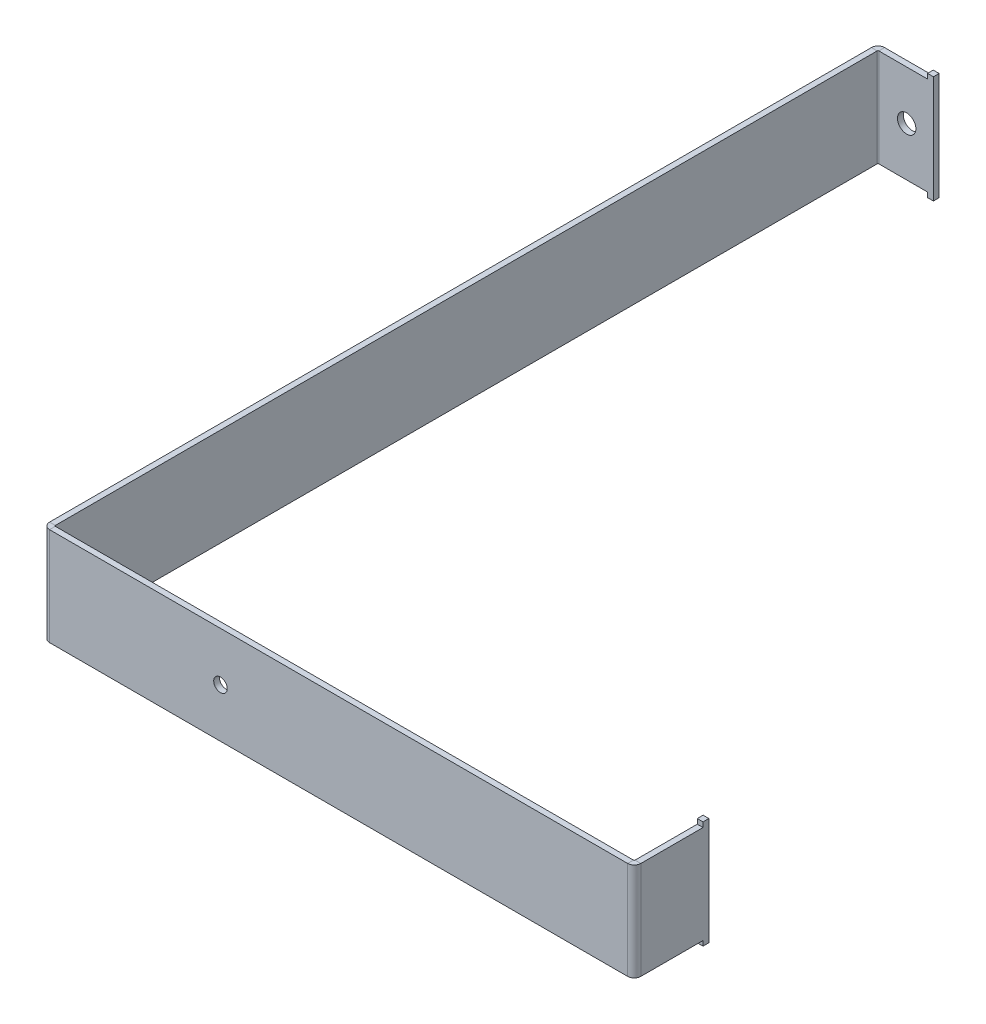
ISO-10303-21;
HEADER;
FILE_DESCRIPTION(('STEP AP214'),'2;1');
FILE_NAME('part.step','',(''),(''),'','','');
FILE_SCHEMA(('AUTOMOTIVE_DESIGN { 1 0 10303 214 1 1 1 1 }'));
ENDSEC;
DATA;
#1=APPLICATION_CONTEXT('core data for automotive mechanical design processes');
#2=APPLICATION_PROTOCOL_DEFINITION('international standard','automotive_design',2000,#1);
#3=PRODUCT_CONTEXT('',#1,'mechanical');
#4=PRODUCT('Part','Part','',(#3));
#5=PRODUCT_RELATED_PRODUCT_CATEGORY('part','',(#4));
#6=PRODUCT_DEFINITION_FORMATION('','',#4);
#7=PRODUCT_DEFINITION_CONTEXT('part definition',#1,'design');
#8=PRODUCT_DEFINITION('design','',#6,#7);
#9=PRODUCT_DEFINITION_SHAPE('','',#8);
#10=(LENGTH_UNIT() NAMED_UNIT(*) SI_UNIT(.MILLI.,.METRE.));
#11=(NAMED_UNIT(*) PLANE_ANGLE_UNIT() SI_UNIT($,.RADIAN.));
#12=(NAMED_UNIT(*) SI_UNIT($,.STERADIAN.) SOLID_ANGLE_UNIT());
#13=UNCERTAINTY_MEASURE_WITH_UNIT(LENGTH_MEASURE(1.E-05),#10,'distance_accuracy_value','');
#14=(GEOMETRIC_REPRESENTATION_CONTEXT(3) GLOBAL_UNCERTAINTY_ASSIGNED_CONTEXT((#13)) GLOBAL_UNIT_ASSIGNED_CONTEXT((#10,
#11,#12)) REPRESENTATION_CONTEXT('',''));
#15=CARTESIAN_POINT('',(0.,0.,0.));
#16=DIRECTION('',(0.,0.,1.));
#17=DIRECTION('',(1.,0.,0.));
#18=AXIS2_PLACEMENT_3D('',#15,#16,#17);
#19=CARTESIAN_POINT('',(-15.8764,0.,-15.0396));
#20=DIRECTION('',(-1.,0.,0.));
#21=DIRECTION('',(0.,0.,1.));
#22=AXIS2_PLACEMENT_3D('',#19,#20,#21);
#23=PLANE('',#22);
#24=DIRECTION('',(0.,0.,-1.));
#25=VECTOR('',#24,1.);
#26=CARTESIAN_POINT('',(-15.8763999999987,12.6999999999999,381.937));
#27=LINE('',#26,#25);
#28=CARTESIAN_POINT('',(-15.8763999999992,12.6999999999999,213.5618));
#29=VERTEX_POINT('',#28);
#30=CARTESIAN_POINT('',(-15.8764,12.7,0.20320000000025));
#31=VERTEX_POINT('',#30);
#32=EDGE_CURVE('E271',#29,#31,#27,.T.);
#33=ORIENTED_EDGE('',*,*,#32,.T.);
#34=DIRECTION('',(0.,-1.,0.));
#35=VECTOR('',#34,1.);
#36=CARTESIAN_POINT('',(-15.8764,0.,0.203200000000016));
#37=LINE('',#36,#35);
#38=CARTESIAN_POINT('',(-15.8764,-12.7,0.203200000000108));
#39=VERTEX_POINT('',#38);
#40=EDGE_CURVE('E358',#31,#39,#37,.T.);
#41=ORIENTED_EDGE('',*,*,#40,.T.);
#42=DIRECTION('',(0.,0.,1.));
#43=VECTOR('',#42,1.);
#44=CARTESIAN_POINT('',(-15.8763999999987,-12.7000000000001,381.937));
#45=LINE('',#44,#43);
#46=CARTESIAN_POINT('',(-15.8763999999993,-12.7,213.5618));
#47=VERTEX_POINT('',#46);
#48=EDGE_CURVE('E274',#39,#47,#45,.T.);
#49=ORIENTED_EDGE('',*,*,#48,.T.);
#50=DIRECTION('',(0.,-1.,0.));
#51=VECTOR('',#50,1.);
#52=CARTESIAN_POINT('',(-15.8763999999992,0.,213.5618));
#53=LINE('',#52,#51);
#54=EDGE_CURVE('E253',#29,#47,#53,.T.);
#55=ORIENTED_EDGE('',*,*,#54,.F.);
#56=EDGE_LOOP('',(#33,#41,#49,#55));
#57=FACE_BOUND('',#56,.T.);
#58=ADVANCED_FACE('F48',(#57),#23,.T.);
#59=CARTESIAN_POINT('',(-14.3764,0.,-15.0396));
#60=DIRECTION('',(-1.,0.,0.));
#61=DIRECTION('',(0.,0.,1.));
#62=AXIS2_PLACEMENT_3D('',#59,#60,#61);
#63=PLANE('',#62);
#64=DIRECTION('',(0.,-1.,0.));
#65=VECTOR('',#64,1.);
#66=CARTESIAN_POINT('',(-14.3764,0.,0.203200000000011));
#67=LINE('',#66,#65);
#68=CARTESIAN_POINT('',(-14.3764,12.7,0.203200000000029));
#69=VERTEX_POINT('',#68);
#70=CARTESIAN_POINT('',(-14.3764,-12.7,0.203200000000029));
#71=VERTEX_POINT('',#70);
#72=EDGE_CURVE('E369',#69,#71,#67,.T.);
#73=ORIENTED_EDGE('',*,*,#72,.F.);
#74=DIRECTION('',(0.,0.,-1.));
#75=VECTOR('',#74,1.);
#76=CARTESIAN_POINT('',(-14.3763999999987,12.6999999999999,381.937));
#77=LINE('',#76,#75);
#78=CARTESIAN_POINT('',(-14.3763999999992,12.6999999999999,213.5618));
#79=VERTEX_POINT('',#78);
#80=EDGE_CURVE('E267',#79,#69,#77,.T.);
#81=ORIENTED_EDGE('',*,*,#80,.F.);
#82=DIRECTION('',(0.,-1.,0.));
#83=VECTOR('',#82,1.);
#84=CARTESIAN_POINT('',(-14.3763999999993,0.,213.5618));
#85=LINE('',#84,#83);
#86=CARTESIAN_POINT('',(-14.3763999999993,-12.7,213.5618));
#87=VERTEX_POINT('',#86);
#88=EDGE_CURVE('E268',#79,#87,#85,.T.);
#89=ORIENTED_EDGE('',*,*,#88,.T.);
#90=DIRECTION('',(0.,0.,1.));
#91=VECTOR('',#90,1.);
#92=CARTESIAN_POINT('',(-14.3763999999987,-12.7000000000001,381.937));
#93=LINE('',#92,#91);
#94=EDGE_CURVE('E263',#71,#87,#93,.T.);
#95=ORIENTED_EDGE('',*,*,#94,.F.);
#96=EDGE_LOOP('',(#73,#81,#89,#95));
#97=FACE_BOUND('',#96,.T.);
#98=ADVANCED_FACE('F50',(#97),#63,.F.);
#99=CARTESIAN_POINT('',(-243.844199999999,0.,215.265000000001));
#100=DIRECTION('',(0.,0.,1.));
#101=DIRECTION('',(1.,0.,0.));
#102=AXIS2_PLACEMENT_3D('',#99,#100,#101);
#103=PLANE('',#102);
#104=CARTESIAN_POINT('',(30.1964000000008,0.,215.265));
#105=DIRECTION('',(0.,0.,-1.));
#106=DIRECTION('',(-1.,0.,0.));
#107=AXIS2_PLACEMENT_3D('',#104,#105,#106);
#108=CIRCLE('',#107,1.75259999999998);
#109=CARTESIAN_POINT('',(28.4438000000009,0.,215.265));
#110=VERTEX_POINT('',#109);
#111=EDGE_CURVE('E297',#110,#110,#108,.T.);
#112=ORIENTED_EDGE('',*,*,#111,.T.);
#113=EDGE_LOOP('',(#112));
#114=FACE_BOUND('',#113,.T.);
#115=DIRECTION('',(-1.,0.,0.));
#116=VECTOR('',#115,1.);
#117=CARTESIAN_POINT('',(153.132400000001,12.6999999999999,215.264999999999));
#118=LINE('',#117,#116);
#119=CARTESIAN_POINT('',(135.911200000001,12.6999999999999,215.264999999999));
#120=VERTEX_POINT('',#119);
#121=CARTESIAN_POINT('',(-14.1731999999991,12.6999999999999,215.265));
#122=VERTEX_POINT('',#121);
#123=EDGE_CURVE('E300',#120,#122,#118,.T.);
#124=ORIENTED_EDGE('',*,*,#123,.T.);
#125=DIRECTION('',(0.,-1.,0.));
#126=VECTOR('',#125,1.);
#127=CARTESIAN_POINT('',(-14.1731999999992,0.,215.265));
#128=LINE('',#127,#126);
#129=CARTESIAN_POINT('',(-14.1731999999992,-12.7,215.265));
#130=VERTEX_POINT('',#129);
#131=EDGE_CURVE('E342',#122,#130,#128,.T.);
#132=ORIENTED_EDGE('',*,*,#131,.T.);
#133=DIRECTION('',(1.,0.,0.));
#134=VECTOR('',#133,1.);
#135=CARTESIAN_POINT('',(153.132400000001,-12.7000000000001,215.264999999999));
#136=LINE('',#135,#134);
#137=CARTESIAN_POINT('',(135.911200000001,-12.7000000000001,215.264999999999));
#138=VERTEX_POINT('',#137);
#139=EDGE_CURVE('E304',#130,#138,#136,.T.);
#140=ORIENTED_EDGE('',*,*,#139,.T.);
#141=DIRECTION('',(0.,-1.,0.));
#142=VECTOR('',#141,1.);
#143=CARTESIAN_POINT('',(135.911200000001,0.,215.264999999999));
#144=LINE('',#143,#142);
#145=EDGE_CURVE('E281',#120,#138,#144,.T.);
#146=ORIENTED_EDGE('',*,*,#145,.F.);
#147=EDGE_LOOP('',(#124,#132,#140,#146));
#148=FACE_BOUND('',#147,.T.);
#149=ADVANCED_FACE('F495',(#114,#148),#103,.T.);
#150=CARTESIAN_POINT('',(-243.844199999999,0.,213.765000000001));
#151=DIRECTION('',(0.,0.,1.));
#152=DIRECTION('',(1.,0.,0.));
#153=AXIS2_PLACEMENT_3D('',#150,#151,#152);
#154=PLANE('',#153);
#155=DIRECTION('',(0.,-1.,0.));
#156=VECTOR('',#155,1.);
#157=CARTESIAN_POINT('',(-14.1731999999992,0.,213.765));
#158=LINE('',#157,#156);
#159=CARTESIAN_POINT('',(-14.1731999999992,12.6999999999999,213.765));
#160=VERTEX_POINT('',#159);
#161=CARTESIAN_POINT('',(-14.1731999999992,-12.7,213.765));
#162=VERTEX_POINT('',#161);
#163=EDGE_CURVE('E353',#160,#162,#158,.T.);
#164=ORIENTED_EDGE('',*,*,#163,.F.);
#165=DIRECTION('',(-1.,0.,0.));
#166=VECTOR('',#165,1.);
#167=CARTESIAN_POINT('',(153.132400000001,12.6999999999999,213.764999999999));
#168=LINE('',#167,#166);
#169=CARTESIAN_POINT('',(135.911200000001,12.6999999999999,213.764999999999));
#170=VERTEX_POINT('',#169);
#171=EDGE_CURVE('E293',#170,#160,#168,.T.);
#172=ORIENTED_EDGE('',*,*,#171,.F.);
#173=DIRECTION('',(0.,-1.,0.));
#174=VECTOR('',#173,1.);
#175=CARTESIAN_POINT('',(135.911200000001,0.,213.764999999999));
#176=LINE('',#175,#174);
#177=CARTESIAN_POINT('',(135.911200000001,-12.7000000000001,213.764999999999));
#178=VERTEX_POINT('',#177);
#179=EDGE_CURVE('E294',#170,#178,#176,.T.);
#180=ORIENTED_EDGE('',*,*,#179,.T.);
#181=DIRECTION('',(1.,0.,0.));
#182=VECTOR('',#181,1.);
#183=CARTESIAN_POINT('',(153.132400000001,-12.7000000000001,213.764999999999));
#184=LINE('',#183,#182);
#185=EDGE_CURVE('E289',#162,#178,#184,.T.);
#186=ORIENTED_EDGE('',*,*,#185,.F.);
#187=EDGE_LOOP('',(#164,#172,#180,#186));
#188=FACE_BOUND('',#187,.T.);
#189=CARTESIAN_POINT('',(30.1964000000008,0.,213.765));
#190=DIRECTION('',(0.,0.,-1.));
#191=DIRECTION('',(-1.,0.,0.));
#192=AXIS2_PLACEMENT_3D('',#189,#190,#191);
#193=CIRCLE('',#192,1.75259999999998);
#194=CARTESIAN_POINT('',(28.4438000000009,0.,213.765));
#195=VERTEX_POINT('',#194);
#196=EDGE_CURVE('E301',#195,#195,#193,.T.);
#197=ORIENTED_EDGE('',*,*,#196,.F.);
#198=EDGE_LOOP('',(#197));
#199=FACE_BOUND('',#198,.T.);
#200=ADVANCED_FACE('F514',(#188,#199),#154,.F.);
#201=CARTESIAN_POINT('',(137.614400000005,-1.30004753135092E-13,594.386799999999));
#202=DIRECTION('',(1.,0.,0.));
#203=DIRECTION('',(0.,0.,-1.));
#204=AXIS2_PLACEMENT_3D('',#201,#202,#203);
#205=PLANE('',#204);
#206=DIRECTION('',(0.,0.,1.));
#207=VECTOR('',#206,1.);
#208=CARTESIAN_POINT('',(137.614400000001,-13.97,-1.5));
#209=LINE('',#208,#207);
#210=CARTESIAN_POINT('',(137.614400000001,-13.97,195.886199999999));
#211=VERTEX_POINT('',#210);
#212=CARTESIAN_POINT('',(137.614400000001,-13.97,197.410199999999));
#213=VERTEX_POINT('',#212);
#214=EDGE_CURVE('E63',#211,#213,#209,.T.);
#215=ORIENTED_EDGE('',*,*,#214,.F.);
#216=DIRECTION('',(0.,-1.,0.));
#217=VECTOR('',#216,1.);
#218=CARTESIAN_POINT('',(137.614400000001,-53.0035349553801,195.886199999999));
#219=LINE('',#218,#217);
#220=CARTESIAN_POINT('',(137.614400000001,13.9699999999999,195.886199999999));
#221=VERTEX_POINT('',#220);
#222=EDGE_CURVE('E327',#221,#211,#219,.T.);
#223=ORIENTED_EDGE('',*,*,#222,.F.);
#224=DIRECTION('',(0.,0.,1.));
#225=VECTOR('',#224,1.);
#226=CARTESIAN_POINT('',(137.614400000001,13.9699999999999,-1.5));
#227=LINE('',#226,#225);
#228=CARTESIAN_POINT('',(137.614400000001,13.9699999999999,197.410199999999));
#229=VERTEX_POINT('',#228);
#230=EDGE_CURVE('E451',#221,#229,#227,.T.);
#231=ORIENTED_EDGE('',*,*,#230,.T.);
#232=DIRECTION('',(0.,-1.,0.));
#233=VECTOR('',#232,1.);
#234=CARTESIAN_POINT('',(137.614400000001,12.6999999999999,197.410199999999));
#235=LINE('',#234,#233);
#236=CARTESIAN_POINT('',(137.614400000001,12.6999999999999,197.410199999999));
#237=VERTEX_POINT('',#236);
#238=EDGE_CURVE('E307',#229,#237,#235,.T.);
#239=ORIENTED_EDGE('',*,*,#238,.T.);
#240=DIRECTION('',(0.,0.,1.));
#241=VECTOR('',#240,1.);
#242=CARTESIAN_POINT('',(137.614400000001,12.6999999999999,197.410199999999));
#243=LINE('',#242,#241);
#244=CARTESIAN_POINT('',(137.614400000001,12.6999999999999,213.561799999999));
#245=VERTEX_POINT('',#244);
#246=EDGE_CURVE('E309',#237,#245,#243,.T.);
#247=ORIENTED_EDGE('',*,*,#246,.T.);
#248=DIRECTION('',(0.,-1.,0.));
#249=VECTOR('',#248,1.);
#250=CARTESIAN_POINT('',(137.614400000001,0.,213.561799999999));
#251=LINE('',#250,#249);
#252=CARTESIAN_POINT('',(137.614400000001,-12.7000000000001,213.561799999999));
#253=VERTEX_POINT('',#252);
#254=EDGE_CURVE('E330',#245,#253,#251,.T.);
#255=ORIENTED_EDGE('',*,*,#254,.T.);
#256=DIRECTION('',(0.,0.,-1.));
#257=VECTOR('',#256,1.);
#258=CARTESIAN_POINT('',(137.614400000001,-12.7000000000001,197.410199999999));
#259=LINE('',#258,#257);
#260=CARTESIAN_POINT('',(137.614400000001,-12.7000000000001,197.410199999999));
#261=VERTEX_POINT('',#260);
#262=EDGE_CURVE('E319',#253,#261,#259,.T.);
#263=ORIENTED_EDGE('',*,*,#262,.T.);
#264=DIRECTION('',(0.,-1.,0.));
#265=VECTOR('',#264,1.);
#266=CARTESIAN_POINT('',(137.614400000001,-15.24,197.410199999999));
#267=LINE('',#266,#265);
#268=EDGE_CURVE('E316',#261,#213,#267,.T.);
#269=ORIENTED_EDGE('',*,*,#268,.T.);
#270=EDGE_LOOP('',(#215,#223,#231,#239,#247,#255,#263,#269));
#271=FACE_BOUND('',#270,.T.);
#272=ADVANCED_FACE('F525',(#271),#205,.T.);
#273=CARTESIAN_POINT('',(137.614400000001,-53.0035349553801,195.886199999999));
#274=DIRECTION('',(0.,0.,-1.));
#275=DIRECTION('',(-1.,0.,0.));
#276=AXIS2_PLACEMENT_3D('',#273,#274,#275);
#277=PLANE('',#276);
#278=DIRECTION('',(1.,0.,0.));
#279=VECTOR('',#278,1.);
#280=CARTESIAN_POINT('',(137.614400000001,-13.97,195.886199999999));
#281=LINE('',#280,#279);
#282=CARTESIAN_POINT('',(136.114400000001,-13.97,195.886199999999));
#283=VERTEX_POINT('',#282);
#284=EDGE_CURVE('E455',#283,#211,#281,.T.);
#285=ORIENTED_EDGE('',*,*,#284,.F.);
#286=DIRECTION('',(0.,-1.,0.));
#287=VECTOR('',#286,1.);
#288=CARTESIAN_POINT('',(136.114400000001,-53.0035349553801,195.886199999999));
#289=LINE('',#288,#287);
#290=CARTESIAN_POINT('',(136.114400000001,13.9699999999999,195.886199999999));
#291=VERTEX_POINT('',#290);
#292=EDGE_CURVE('E326',#291,#283,#289,.T.);
#293=ORIENTED_EDGE('',*,*,#292,.F.);
#294=DIRECTION('',(-1.,0.,0.));
#295=VECTOR('',#294,1.);
#296=CARTESIAN_POINT('',(137.614400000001,13.9699999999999,195.886199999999));
#297=LINE('',#296,#295);
#298=EDGE_CURVE('E437',#221,#291,#297,.T.);
#299=ORIENTED_EDGE('',*,*,#298,.F.);
#300=ORIENTED_EDGE('',*,*,#222,.T.);
#301=EDGE_LOOP('',(#285,#293,#299,#300));
#302=FACE_BOUND('',#301,.T.);
#303=ADVANCED_FACE('F540',(#302),#277,.T.);
#304=CARTESIAN_POINT('',(136.114400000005,-1.29748642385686E-13,594.386799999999));
#305=DIRECTION('',(1.,0.,0.));
#306=DIRECTION('',(0.,0.,-1.));
#307=AXIS2_PLACEMENT_3D('',#304,#305,#306);
#308=PLANE('',#307);
#309=ORIENTED_EDGE('',*,*,#292,.T.);
#310=DIRECTION('',(0.,0.,1.));
#311=VECTOR('',#310,1.);
#312=CARTESIAN_POINT('',(136.114400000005,-13.97,594.386799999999));
#313=LINE('',#312,#311);
#314=CARTESIAN_POINT('',(136.114400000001,-13.97,197.410199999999));
#315=VERTEX_POINT('',#314);
#316=EDGE_CURVE('E457',#283,#315,#313,.T.);
#317=ORIENTED_EDGE('',*,*,#316,.T.);
#318=DIRECTION('',(0.,-1.,0.));
#319=VECTOR('',#318,1.);
#320=CARTESIAN_POINT('',(136.114400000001,-15.24,197.410199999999));
#321=LINE('',#320,#319);
#322=CARTESIAN_POINT('',(136.114400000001,-12.7000000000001,197.410199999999));
#323=VERTEX_POINT('',#322);
#324=EDGE_CURVE('E315',#323,#315,#321,.T.);
#325=ORIENTED_EDGE('',*,*,#324,.F.);
#326=DIRECTION('',(0.,0.,-1.));
#327=VECTOR('',#326,1.);
#328=CARTESIAN_POINT('',(136.114400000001,-12.7000000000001,197.410199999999));
#329=LINE('',#328,#327);
#330=CARTESIAN_POINT('',(136.114400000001,-12.7000000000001,213.561799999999));
#331=VERTEX_POINT('',#330);
#332=EDGE_CURVE('E320',#331,#323,#329,.T.);
#333=ORIENTED_EDGE('',*,*,#332,.F.);
#334=DIRECTION('',(0.,-1.,0.));
#335=VECTOR('',#334,1.);
#336=CARTESIAN_POINT('',(136.114400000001,0.,213.561799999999));
#337=LINE('',#336,#335);
#338=CARTESIAN_POINT('',(136.114400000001,12.6999999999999,213.561799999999));
#339=VERTEX_POINT('',#338);
#340=EDGE_CURVE('E337',#339,#331,#337,.T.);
#341=ORIENTED_EDGE('',*,*,#340,.F.);
#342=DIRECTION('',(0.,0.,1.));
#343=VECTOR('',#342,1.);
#344=CARTESIAN_POINT('',(136.114400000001,12.6999999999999,197.410199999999));
#345=LINE('',#344,#343);
#346=CARTESIAN_POINT('',(136.114400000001,12.6999999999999,197.410199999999));
#347=VERTEX_POINT('',#346);
#348=EDGE_CURVE('E310',#347,#339,#345,.T.);
#349=ORIENTED_EDGE('',*,*,#348,.F.);
#350=DIRECTION('',(0.,-1.,0.));
#351=VECTOR('',#350,1.);
#352=CARTESIAN_POINT('',(136.114400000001,12.6999999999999,197.410199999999));
#353=LINE('',#352,#351);
#354=CARTESIAN_POINT('',(136.114400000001,13.9699999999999,197.410199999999));
#355=VERTEX_POINT('',#354);
#356=EDGE_CURVE('E288',#355,#347,#353,.T.);
#357=ORIENTED_EDGE('',*,*,#356,.F.);
#358=DIRECTION('',(0.,0.,-1.));
#359=VECTOR('',#358,1.);
#360=CARTESIAN_POINT('',(136.114400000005,13.9699999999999,594.386799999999));
#361=LINE('',#360,#359);
#362=EDGE_CURVE('E442',#355,#291,#361,.T.);
#363=ORIENTED_EDGE('',*,*,#362,.T.);
#364=EDGE_LOOP('',(#309,#317,#325,#333,#341,#349,#357,#363));
#365=FACE_BOUND('',#364,.T.);
#366=ADVANCED_FACE('F546',(#365),#308,.F.);
#367=CARTESIAN_POINT('',(137.614400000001,-15.24,197.410199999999));
#368=DIRECTION('',(0.,0.,-1.));
#369=DIRECTION('',(-1.,0.,0.));
#370=AXIS2_PLACEMENT_3D('',#367,#368,#369);
#371=PLANE('',#370);
#372=ORIENTED_EDGE('',*,*,#324,.T.);
#373=DIRECTION('',(1.,0.,0.));
#374=VECTOR('',#373,1.);
#375=CARTESIAN_POINT('',(137.614400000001,-13.97,197.410199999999));
#376=LINE('',#375,#374);
#377=EDGE_CURVE('E460',#315,#213,#376,.T.);
#378=ORIENTED_EDGE('',*,*,#377,.T.);
#379=ORIENTED_EDGE('',*,*,#268,.F.);
#380=DIRECTION('',(-1.,0.,0.));
#381=VECTOR('',#380,1.);
#382=CARTESIAN_POINT('',(137.614400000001,-12.7000000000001,197.410199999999));
#383=LINE('',#382,#381);
#384=EDGE_CURVE('E323',#261,#323,#383,.T.);
#385=ORIENTED_EDGE('',*,*,#384,.T.);
#386=EDGE_LOOP('',(#372,#378,#379,#385));
#387=FACE_BOUND('',#386,.T.);
#388=ADVANCED_FACE('F535',(#387),#371,.F.);
#389=CARTESIAN_POINT('',(137.614400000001,-12.7000000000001,197.410199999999));
#390=DIRECTION('',(0.,1.,0.));
#391=DIRECTION('',(-1.,0.,0.));
#392=AXIS2_PLACEMENT_3D('',#389,#390,#391);
#393=PLANE('',#392);
#394=DIRECTION('',(1.,0.,0.));
#395=VECTOR('',#394,1.);
#396=CARTESIAN_POINT('',(137.614400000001,-12.7000000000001,213.561799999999));
#397=LINE('',#396,#395);
#398=EDGE_CURVE('E339',#331,#253,#397,.T.);
#399=ORIENTED_EDGE('',*,*,#398,.F.);
#400=ORIENTED_EDGE('',*,*,#332,.T.);
#401=ORIENTED_EDGE('',*,*,#384,.F.);
#402=ORIENTED_EDGE('',*,*,#262,.F.);
#403=EDGE_LOOP('',(#399,#400,#401,#402));
#404=FACE_BOUND('',#403,.T.);
#405=ADVANCED_FACE('F531',(#404),#393,.F.);
#406=CARTESIAN_POINT('',(137.614400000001,12.6999999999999,197.410199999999));
#407=DIRECTION('',(0.,0.,-1.));
#408=DIRECTION('',(-1.,0.,0.));
#409=AXIS2_PLACEMENT_3D('',#406,#407,#408);
#410=PLANE('',#409);
#411=ORIENTED_EDGE('',*,*,#238,.F.);
#412=DIRECTION('',(-1.,0.,0.));
#413=VECTOR('',#412,1.);
#414=CARTESIAN_POINT('',(137.614400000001,13.9699999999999,197.410199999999));
#415=LINE('',#414,#413);
#416=EDGE_CURVE('E445',#229,#355,#415,.T.);
#417=ORIENTED_EDGE('',*,*,#416,.T.);
#418=ORIENTED_EDGE('',*,*,#356,.T.);
#419=DIRECTION('',(-1.,0.,0.));
#420=VECTOR('',#419,1.);
#421=CARTESIAN_POINT('',(137.614400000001,12.6999999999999,197.410199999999));
#422=LINE('',#421,#420);
#423=EDGE_CURVE('E312',#237,#347,#422,.T.);
#424=ORIENTED_EDGE('',*,*,#423,.F.);
#425=EDGE_LOOP('',(#411,#417,#418,#424));
#426=FACE_BOUND('',#425,.T.);
#427=ADVANCED_FACE('F551',(#426),#410,.F.);
#428=CARTESIAN_POINT('',(137.614400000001,12.6999999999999,197.410199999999));
#429=DIRECTION('',(0.,-1.,0.));
#430=DIRECTION('',(1.,0.,0.));
#431=AXIS2_PLACEMENT_3D('',#428,#429,#430);
#432=PLANE('',#431);
#433=DIRECTION('',(-1.,0.,0.));
#434=VECTOR('',#433,1.);
#435=CARTESIAN_POINT('',(137.614400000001,12.6999999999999,213.561799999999));
#436=LINE('',#435,#434);
#437=EDGE_CURVE('E335',#245,#339,#436,.T.);
#438=ORIENTED_EDGE('',*,*,#437,.F.);
#439=ORIENTED_EDGE('',*,*,#246,.F.);
#440=ORIENTED_EDGE('',*,*,#423,.T.);
#441=ORIENTED_EDGE('',*,*,#348,.T.);
#442=EDGE_LOOP('',(#438,#439,#440,#441));
#443=FACE_BOUND('',#442,.T.);
#444=ADVANCED_FACE('F553',(#443),#432,.F.);
#445=CARTESIAN_POINT('',(30.1964000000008,0.,215.265));
#446=DIRECTION('',(0.,0.,-1.));
#447=DIRECTION('',(-1.,0.,0.));
#448=AXIS2_PLACEMENT_3D('',#445,#446,#447);
#449=CYLINDRICAL_SURFACE('',#448,1.75259999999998);
#450=ORIENTED_EDGE('',*,*,#111,.F.);
#451=EDGE_LOOP('',(#450));
#452=FACE_BOUND('',#451,.T.);
#453=ORIENTED_EDGE('',*,*,#196,.T.);
#454=EDGE_LOOP('',(#453));
#455=FACE_BOUND('',#454,.T.);
#456=ADVANCED_FACE('F580',(#452,#455),#449,.F.);
#457=CARTESIAN_POINT('',(153.132400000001,12.6999999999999,215.264999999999));
#458=DIRECTION('',(0.,-1.,0.));
#459=DIRECTION('',(0.,0.,1.));
#460=AXIS2_PLACEMENT_3D('',#457,#458,#459);
#461=PLANE('',#460);
#462=DIRECTION('',(0.,0.,-1.));
#463=VECTOR('',#462,1.);
#464=CARTESIAN_POINT('',(-14.1731999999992,12.6999999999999,215.265));
#465=LINE('',#464,#463);
#466=EDGE_CURVE('E351',#122,#160,#465,.T.);
#467=ORIENTED_EDGE('',*,*,#466,.F.);
#468=ORIENTED_EDGE('',*,*,#123,.F.);
#469=DIRECTION('',(0.,0.,-1.));
#470=VECTOR('',#469,1.);
#471=CARTESIAN_POINT('',(135.911200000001,12.6999999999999,215.264999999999));
#472=LINE('',#471,#470);
#473=EDGE_CURVE('E290',#120,#170,#472,.T.);
#474=ORIENTED_EDGE('',*,*,#473,.T.);
#475=ORIENTED_EDGE('',*,*,#171,.T.);
#476=EDGE_LOOP('',(#467,#468,#474,#475));
#477=FACE_BOUND('',#476,.T.);
#478=ADVANCED_FACE('F517',(#477),#461,.F.);
#479=CARTESIAN_POINT('',(153.132400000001,-12.7000000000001,215.264999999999));
#480=DIRECTION('',(0.,1.,0.));
#481=DIRECTION('',(0.,0.,-1.));
#482=AXIS2_PLACEMENT_3D('',#479,#480,#481);
#483=PLANE('',#482);
#484=DIRECTION('',(0.,0.,1.));
#485=VECTOR('',#484,1.);
#486=CARTESIAN_POINT('',(-14.1731999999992,-12.7,215.265));
#487=LINE('',#486,#485);
#488=EDGE_CURVE('E355',#162,#130,#487,.T.);
#489=ORIENTED_EDGE('',*,*,#488,.F.);
#490=ORIENTED_EDGE('',*,*,#185,.T.);
#491=DIRECTION('',(0.,0.,1.));
#492=VECTOR('',#491,1.);
#493=CARTESIAN_POINT('',(135.911200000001,-12.7000000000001,215.264999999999));
#494=LINE('',#493,#492);
#495=EDGE_CURVE('E285',#178,#138,#494,.T.);
#496=ORIENTED_EDGE('',*,*,#495,.T.);
#497=ORIENTED_EDGE('',*,*,#139,.F.);
#498=EDGE_LOOP('',(#489,#490,#496,#497));
#499=FACE_BOUND('',#498,.T.);
#500=ADVANCED_FACE('F499',(#499),#483,.F.);
#501=CARTESIAN_POINT('',(135.911200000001,12.6999999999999,213.561799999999));
#502=DIRECTION('',(0.,1.,0.));
#503=DIRECTION('',(0.,0.,-1.));
#504=AXIS2_PLACEMENT_3D('',#501,#502,#503);
#505=PLANE('',#504);
#506=ORIENTED_EDGE('',*,*,#437,.T.);
#507=CARTESIAN_POINT('',(135.911200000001,12.6999999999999,213.561799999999));
#508=DIRECTION('',(0.,1.,0.));
#509=DIRECTION('',(0.,0.,-1.));
#510=AXIS2_PLACEMENT_3D('',#507,#508,#509);
#511=CIRCLE('',#510,0.2032);
#512=EDGE_CURVE('E262',#339,#170,#511,.F.);
#513=ORIENTED_EDGE('',*,*,#512,.T.);
#514=ORIENTED_EDGE('',*,*,#473,.F.);
#515=CARTESIAN_POINT('',(135.911200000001,12.6999999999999,213.561799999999));
#516=DIRECTION('',(0.,-1.,0.));
#517=DIRECTION('',(0.,0.,1.));
#518=AXIS2_PLACEMENT_3D('',#515,#516,#517);
#519=CIRCLE('',#518,1.70320000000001);
#520=EDGE_CURVE('E275',#245,#120,#519,.T.);
#521=ORIENTED_EDGE('',*,*,#520,.F.);
#522=EDGE_LOOP('',(#506,#513,#514,#521));
#523=FACE_BOUND('',#522,.T.);
#524=ADVANCED_FACE('F520',(#523),#505,.T.);
#525=CARTESIAN_POINT('',(135.911200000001,-12.7000000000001,213.561799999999));
#526=DIRECTION('',(0.,-1.,0.));
#527=DIRECTION('',(0.,0.,1.));
#528=AXIS2_PLACEMENT_3D('',#525,#526,#527);
#529=PLANE('',#528);
#530=CARTESIAN_POINT('',(135.911200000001,-12.7000000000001,213.561799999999));
#531=DIRECTION('',(0.,1.,0.));
#532=DIRECTION('',(0.,0.,-1.));
#533=AXIS2_PLACEMENT_3D('',#530,#531,#532);
#534=CIRCLE('',#533,0.2032);
#535=EDGE_CURVE('E279',#178,#331,#534,.T.);
#536=ORIENTED_EDGE('',*,*,#535,.T.);
#537=ORIENTED_EDGE('',*,*,#398,.T.);
#538=CARTESIAN_POINT('',(135.911200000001,-12.7000000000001,213.561799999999));
#539=DIRECTION('',(0.,1.,0.));
#540=DIRECTION('',(0.,0.,-1.));
#541=AXIS2_PLACEMENT_3D('',#538,#539,#540);
#542=CIRCLE('',#541,1.70320000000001);
#543=EDGE_CURVE('E278',#138,#253,#542,.T.);
#544=ORIENTED_EDGE('',*,*,#543,.F.);
#545=ORIENTED_EDGE('',*,*,#495,.F.);
#546=EDGE_LOOP('',(#536,#537,#544,#545));
#547=FACE_BOUND('',#546,.T.);
#548=ADVANCED_FACE('F504',(#547),#529,.T.);
#549=CARTESIAN_POINT('',(135.911200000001,-25.46672425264,213.561799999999));
#550=DIRECTION('',(0.,1.,0.));
#551=DIRECTION('',(0.,0.,-1.));
#552=AXIS2_PLACEMENT_3D('',#549,#550,#551);
#553=CYLINDRICAL_SURFACE('',#552,1.7032);
#554=ORIENTED_EDGE('',*,*,#145,.T.);
#555=ORIENTED_EDGE('',*,*,#543,.T.);
#556=ORIENTED_EDGE('',*,*,#254,.F.);
#557=ORIENTED_EDGE('',*,*,#520,.T.);
#558=EDGE_LOOP('',(#554,#555,#556,#557));
#559=FACE_BOUND('',#558,.T.);
#560=ADVANCED_FACE('F522',(#559),#553,.T.);
#561=CARTESIAN_POINT('',(135.911200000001,-25.46672425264,213.561799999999));
#562=DIRECTION('',(0.,1.,0.));
#563=DIRECTION('',(0.,0.,-1.));
#564=AXIS2_PLACEMENT_3D('',#561,#562,#563);
#565=CYLINDRICAL_SURFACE('',#564,0.2032);
#566=ORIENTED_EDGE('',*,*,#179,.F.);
#567=ORIENTED_EDGE('',*,*,#512,.F.);
#568=ORIENTED_EDGE('',*,*,#340,.T.);
#569=ORIENTED_EDGE('',*,*,#535,.F.);
#570=EDGE_LOOP('',(#566,#567,#568,#569));
#571=FACE_BOUND('',#570,.T.);
#572=ADVANCED_FACE('F508',(#571),#565,.F.);
#573=CARTESIAN_POINT('',(-15.8763999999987,12.6999999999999,381.937));
#574=DIRECTION('',(0.,-1.,0.));
#575=DIRECTION('',(-1.,0.,0.));
#576=AXIS2_PLACEMENT_3D('',#573,#574,#575);
#577=PLANE('',#576);
#578=DIRECTION('',(1.,0.,0.));
#579=VECTOR('',#578,1.);
#580=CARTESIAN_POINT('',(-15.8764,12.7,0.203200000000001));
#581=LINE('',#580,#579);
#582=EDGE_CURVE('E367',#31,#69,#581,.T.);
#583=ORIENTED_EDGE('',*,*,#582,.F.);
#584=ORIENTED_EDGE('',*,*,#32,.F.);
#585=DIRECTION('',(1.,0.,0.));
#586=VECTOR('',#585,1.);
#587=CARTESIAN_POINT('',(-15.8763999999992,12.6999999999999,213.5618));
#588=LINE('',#587,#586);
#589=EDGE_CURVE('E264',#29,#79,#588,.T.);
#590=ORIENTED_EDGE('',*,*,#589,.T.);
#591=ORIENTED_EDGE('',*,*,#80,.T.);
#592=EDGE_LOOP('',(#583,#584,#590,#591));
#593=FACE_BOUND('',#592,.T.);
#594=ADVANCED_FACE('F566',(#593),#577,.F.);
#595=CARTESIAN_POINT('',(-15.8763999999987,-12.7000000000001,381.937));
#596=DIRECTION('',(0.,1.,0.));
#597=DIRECTION('',(1.,0.,0.));
#598=AXIS2_PLACEMENT_3D('',#595,#596,#597);
#599=PLANE('',#598);
#600=DIRECTION('',(-1.,0.,0.));
#601=VECTOR('',#600,1.);
#602=CARTESIAN_POINT('',(-15.8764,-12.7,0.203199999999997));
#603=LINE('',#602,#601);
#604=EDGE_CURVE('E371',#71,#39,#603,.T.);
#605=ORIENTED_EDGE('',*,*,#604,.F.);
#606=ORIENTED_EDGE('',*,*,#94,.T.);
#607=DIRECTION('',(-1.,0.,0.));
#608=VECTOR('',#607,1.);
#609=CARTESIAN_POINT('',(-15.8763999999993,-12.7,213.5618));
#610=LINE('',#609,#608);
#611=EDGE_CURVE('E259',#87,#47,#610,.T.);
#612=ORIENTED_EDGE('',*,*,#611,.T.);
#613=ORIENTED_EDGE('',*,*,#48,.F.);
#614=EDGE_LOOP('',(#605,#606,#612,#613));
#615=FACE_BOUND('',#614,.T.);
#616=ADVANCED_FACE('F479',(#615),#599,.F.);
#617=CARTESIAN_POINT('',(-14.1731999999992,12.6999999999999,213.5618));
#618=DIRECTION('',(0.,1.,0.));
#619=DIRECTION('',(1.,0.,0.));
#620=AXIS2_PLACEMENT_3D('',#617,#618,#619);
#621=PLANE('',#620);
#622=ORIENTED_EDGE('',*,*,#466,.T.);
#623=CARTESIAN_POINT('',(-14.1731999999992,12.6999999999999,213.5618));
#624=DIRECTION('',(0.,1.,0.));
#625=DIRECTION('',(1.,0.,0.));
#626=AXIS2_PLACEMENT_3D('',#623,#624,#625);
#627=CIRCLE('',#626,0.2032);
#628=EDGE_CURVE('E254',#160,#79,#627,.F.);
#629=ORIENTED_EDGE('',*,*,#628,.T.);
#630=ORIENTED_EDGE('',*,*,#589,.F.);
#631=CARTESIAN_POINT('',(-14.1731999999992,12.6999999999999,213.5618));
#632=DIRECTION('',(0.,-1.,0.));
#633=DIRECTION('',(-1.,0.,0.));
#634=AXIS2_PLACEMENT_3D('',#631,#632,#633);
#635=CIRCLE('',#634,1.70319999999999);
#636=EDGE_CURVE('E247',#122,#29,#635,.T.);
#637=ORIENTED_EDGE('',*,*,#636,.F.);
#638=EDGE_LOOP('',(#622,#629,#630,#637));
#639=FACE_BOUND('',#638,.T.);
#640=ADVANCED_FACE('F572',(#639),#621,.T.);
#641=CARTESIAN_POINT('',(-14.1731999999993,-12.7,213.5618));
#642=DIRECTION('',(0.,-1.,0.));
#643=DIRECTION('',(-1.,0.,0.));
#644=AXIS2_PLACEMENT_3D('',#641,#642,#643);
#645=PLANE('',#644);
#646=CARTESIAN_POINT('',(-14.1731999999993,-12.7,213.5618));
#647=DIRECTION('',(0.,1.,0.));
#648=DIRECTION('',(1.,0.,0.));
#649=AXIS2_PLACEMENT_3D('',#646,#647,#648);
#650=CIRCLE('',#649,0.2032);
#651=EDGE_CURVE('E251',#87,#162,#650,.T.);
#652=ORIENTED_EDGE('',*,*,#651,.T.);
#653=ORIENTED_EDGE('',*,*,#488,.T.);
#654=CARTESIAN_POINT('',(-14.1731999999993,-12.7,213.5618));
#655=DIRECTION('',(0.,1.,0.));
#656=DIRECTION('',(1.,0.,0.));
#657=AXIS2_PLACEMENT_3D('',#654,#655,#656);
#658=CIRCLE('',#657,1.70319999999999);
#659=EDGE_CURVE('E250',#47,#130,#658,.T.);
#660=ORIENTED_EDGE('',*,*,#659,.F.);
#661=ORIENTED_EDGE('',*,*,#611,.F.);
#662=EDGE_LOOP('',(#652,#653,#660,#661));
#663=FACE_BOUND('',#662,.T.);
#664=ADVANCED_FACE('F488',(#663),#645,.T.);
#665=CARTESIAN_POINT('',(-14.1731999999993,-25.46672425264,213.5618));
#666=DIRECTION('',(0.,1.,0.));
#667=DIRECTION('',(1.,0.,0.));
#668=AXIS2_PLACEMENT_3D('',#665,#666,#667);
#669=CYLINDRICAL_SURFACE('',#668,1.7032);
#670=ORIENTED_EDGE('',*,*,#54,.T.);
#671=ORIENTED_EDGE('',*,*,#659,.T.);
#672=ORIENTED_EDGE('',*,*,#131,.F.);
#673=ORIENTED_EDGE('',*,*,#636,.T.);
#674=EDGE_LOOP('',(#670,#671,#672,#673));
#675=FACE_BOUND('',#674,.T.);
#676=ADVANCED_FACE('F485',(#675),#669,.T.);
#677=CARTESIAN_POINT('',(-14.1731999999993,-25.46672425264,213.5618));
#678=DIRECTION('',(0.,1.,0.));
#679=DIRECTION('',(1.,0.,0.));
#680=AXIS2_PLACEMENT_3D('',#677,#678,#679);
#681=CYLINDRICAL_SURFACE('',#680,0.2032);
#682=ORIENTED_EDGE('',*,*,#88,.F.);
#683=ORIENTED_EDGE('',*,*,#628,.F.);
#684=ORIENTED_EDGE('',*,*,#163,.T.);
#685=ORIENTED_EDGE('',*,*,#651,.F.);
#686=EDGE_LOOP('',(#682,#683,#684,#685));
#687=FACE_BOUND('',#686,.T.);
#688=ADVANCED_FACE('F613',(#687),#681,.F.);
#689=CARTESIAN_POINT('',(-6.93391241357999,0.,-1.5));
#690=DIRECTION('',(0.,0.,1.));
#691=DIRECTION('',(1.,0.,0.));
#692=AXIS2_PLACEMENT_3D('',#689,#690,#691);
#693=CYLINDRICAL_SURFACE('',#692,2.38760000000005);
#694=CARTESIAN_POINT('',(-6.93391241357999,0.,-1.5));
#695=DIRECTION('',(0.,0.,1.));
#696=DIRECTION('',(1.,0.,0.));
#697=AXIS2_PLACEMENT_3D('',#694,#695,#696);
#698=CIRCLE('',#697,2.38760000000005);
#699=CARTESIAN_POINT('',(-4.54631241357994,0.,-1.5));
#700=VERTEX_POINT('',#699);
#701=EDGE_CURVE('E413',#700,#700,#698,.T.);
#702=ORIENTED_EDGE('',*,*,#701,.F.);
#703=EDGE_LOOP('',(#702));
#704=FACE_BOUND('',#703,.T.);
#705=CARTESIAN_POINT('',(-6.93391241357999,0.,0.));
#706=DIRECTION('',(0.,0.,1.));
#707=DIRECTION('',(1.,0.,0.));
#708=AXIS2_PLACEMENT_3D('',#705,#706,#707);
#709=CIRCLE('',#708,2.38760000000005);
#710=CARTESIAN_POINT('',(-4.54631241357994,0.,0.));
#711=VERTEX_POINT('',#710);
#712=EDGE_CURVE('E241',#711,#711,#709,.T.);
#713=ORIENTED_EDGE('',*,*,#712,.T.);
#714=EDGE_LOOP('',(#713));
#715=FACE_BOUND('',#714,.T.);
#716=ADVANCED_FACE('F616',(#704,#715),#693,.F.);
#717=CARTESIAN_POINT('',(-1.52399999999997,12.7,-1.5));
#718=DIRECTION('',(1.,0.,0.));
#719=DIRECTION('',(0.,0.,-1.));
#720=AXIS2_PLACEMENT_3D('',#717,#718,#719);
#721=PLANE('',#720);
#722=DIRECTION('',(0.,1.,0.));
#723=VECTOR('',#722,1.);
#724=CARTESIAN_POINT('',(-1.52399999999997,12.7,0.));
#725=LINE('',#724,#723);
#726=CARTESIAN_POINT('',(-1.52399999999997,12.7,0.));
#727=VERTEX_POINT('',#726);
#728=CARTESIAN_POINT('',(-1.52399999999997,13.9699999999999,0.));
#729=VERTEX_POINT('',#728);
#730=EDGE_CURVE('E238',#727,#729,#725,.T.);
#731=ORIENTED_EDGE('',*,*,#730,.T.);
#732=DIRECTION('',(0.,0.,-1.));
#733=VECTOR('',#732,1.);
#734=CARTESIAN_POINT('',(-1.52399999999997,13.9699999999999,-1.5));
#735=LINE('',#734,#733);
#736=CARTESIAN_POINT('',(-1.52399999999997,13.9699999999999,-1.5));
#737=VERTEX_POINT('',#736);
#738=EDGE_CURVE('E391',#729,#737,#735,.T.);
#739=ORIENTED_EDGE('',*,*,#738,.T.);
#740=DIRECTION('',(0.,1.,0.));
#741=VECTOR('',#740,1.);
#742=CARTESIAN_POINT('',(-1.52399999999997,12.7,-1.5));
#743=LINE('',#742,#741);
#744=CARTESIAN_POINT('',(-1.52399999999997,12.7,-1.5));
#745=VERTEX_POINT('',#744);
#746=EDGE_CURVE('E393',#745,#737,#743,.T.);
#747=ORIENTED_EDGE('',*,*,#746,.F.);
#748=DIRECTION('',(0.,0.,1.));
#749=VECTOR('',#748,1.);
#750=CARTESIAN_POINT('',(-1.52399999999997,12.7,-1.5));
#751=LINE('',#750,#749);
#752=EDGE_CURVE('E232',#745,#727,#751,.T.);
#753=ORIENTED_EDGE('',*,*,#752,.T.);
#754=EDGE_LOOP('',(#731,#739,#747,#753));
#755=FACE_BOUND('',#754,.T.);
#756=ADVANCED_FACE('F389',(#755),#721,.F.);
#757=CARTESIAN_POINT('',(-1.52399999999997,-15.24,-1.5));
#758=DIRECTION('',(1.,0.,0.));
#759=DIRECTION('',(0.,0.,-1.));
#760=AXIS2_PLACEMENT_3D('',#757,#758,#759);
#761=PLANE('',#760);
#762=DIRECTION('',(0.,1.,0.));
#763=VECTOR('',#762,1.);
#764=CARTESIAN_POINT('',(-1.52399999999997,-15.24,-1.5));
#765=LINE('',#764,#763);
#766=CARTESIAN_POINT('',(-1.52399999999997,-13.97,-1.5));
#767=VERTEX_POINT('',#766);
#768=CARTESIAN_POINT('',(-1.52399999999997,-12.7,-1.5));
#769=VERTEX_POINT('',#768);
#770=EDGE_CURVE('E227',#767,#769,#765,.T.);
#771=ORIENTED_EDGE('',*,*,#770,.F.);
#772=DIRECTION('',(0.,0.,1.));
#773=VECTOR('',#772,1.);
#774=CARTESIAN_POINT('',(-1.52399999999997,-13.97,-1.5));
#775=LINE('',#774,#773);
#776=CARTESIAN_POINT('',(-1.52399999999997,-13.97,0.));
#777=VERTEX_POINT('',#776);
#778=EDGE_CURVE('E209',#767,#777,#775,.T.);
#779=ORIENTED_EDGE('',*,*,#778,.T.);
#780=DIRECTION('',(0.,1.,0.));
#781=VECTOR('',#780,1.);
#782=CARTESIAN_POINT('',(-1.52399999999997,-15.24,0.));
#783=LINE('',#782,#781);
#784=CARTESIAN_POINT('',(-1.52399999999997,-12.7,0.));
#785=VERTEX_POINT('',#784);
#786=EDGE_CURVE('E228',#777,#785,#783,.T.);
#787=ORIENTED_EDGE('',*,*,#786,.T.);
#788=DIRECTION('',(0.,0.,1.));
#789=VECTOR('',#788,1.);
#790=CARTESIAN_POINT('',(-1.52399999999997,-12.7,-1.5));
#791=LINE('',#790,#789);
#792=EDGE_CURVE('E256',#769,#785,#791,.T.);
#793=ORIENTED_EDGE('',*,*,#792,.F.);
#794=EDGE_LOOP('',(#771,#779,#787,#793));
#795=FACE_BOUND('',#794,.T.);
#796=ADVANCED_FACE('F464',(#795),#761,.F.);
#797=CARTESIAN_POINT('',(0.,-40.64,-1.5));
#798=DIRECTION('',(1.,0.,0.));
#799=DIRECTION('',(0.,0.,-1.));
#800=AXIS2_PLACEMENT_3D('',#797,#798,#799);
#801=PLANE('',#800);
#802=DIRECTION('',(0.,0.,1.));
#803=VECTOR('',#802,1.);
#804=CARTESIAN_POINT('',(0.,-13.97,-1.5));
#805=LINE('',#804,#803);
#806=CARTESIAN_POINT('',(0.,-13.97,-1.5));
#807=VERTEX_POINT('',#806);
#808=CARTESIAN_POINT('',(0.,-13.97,0.));
#809=VERTEX_POINT('',#808);
#810=EDGE_CURVE('E71',#807,#809,#805,.T.);
#811=ORIENTED_EDGE('',*,*,#810,.F.);
#812=DIRECTION('',(0.,1.,0.));
#813=VECTOR('',#812,1.);
#814=CARTESIAN_POINT('',(0.,-40.64,-1.5));
#815=LINE('',#814,#813);
#816=CARTESIAN_POINT('',(0.,13.9699999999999,-1.5));
#817=VERTEX_POINT('',#816);
#818=EDGE_CURVE('E218',#807,#817,#815,.T.);
#819=ORIENTED_EDGE('',*,*,#818,.T.);
#820=DIRECTION('',(0.,0.,-1.));
#821=VECTOR('',#820,1.);
#822=CARTESIAN_POINT('',(0.,13.9699999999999,-1.5));
#823=LINE('',#822,#821);
#824=CARTESIAN_POINT('',(0.,13.9699999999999,0.));
#825=VERTEX_POINT('',#824);
#826=EDGE_CURVE('E449',#825,#817,#823,.T.);
#827=ORIENTED_EDGE('',*,*,#826,.F.);
#828=DIRECTION('',(0.,1.,0.));
#829=VECTOR('',#828,1.);
#830=CARTESIAN_POINT('',(0.,-40.64,0.));
#831=LINE('',#830,#829);
#832=EDGE_CURVE('E220',#809,#825,#831,.T.);
#833=ORIENTED_EDGE('',*,*,#832,.F.);
#834=EDGE_LOOP('',(#811,#819,#827,#833));
#835=FACE_BOUND('',#834,.T.);
#836=ADVANCED_FACE('F216',(#835),#801,.T.);
#837=CARTESIAN_POINT('',(0.,0.,-1.5));
#838=DIRECTION('',(0.,0.,-1.));
#839=DIRECTION('',(-1.,0.,0.));
#840=AXIS2_PLACEMENT_3D('',#837,#838,#839);
#841=PLANE('',#840);
#842=DIRECTION('',(-1.,0.,0.));
#843=VECTOR('',#842,1.);
#844=CARTESIAN_POINT('',(-15.8763999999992,-13.97,-1.5));
#845=LINE('',#844,#843);
#846=EDGE_CURVE('E206',#807,#767,#845,.T.);
#847=ORIENTED_EDGE('',*,*,#846,.T.);
#848=ORIENTED_EDGE('',*,*,#770,.T.);
#849=DIRECTION('',(-1.,0.,0.));
#850=VECTOR('',#849,1.);
#851=CARTESIAN_POINT('',(-396.9766,-12.7,-1.5));
#852=LINE('',#851,#850);
#853=CARTESIAN_POINT('',(-14.1732000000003,-12.7,-1.5));
#854=VERTEX_POINT('',#853);
#855=EDGE_CURVE('E230',#769,#854,#852,.T.);
#856=ORIENTED_EDGE('',*,*,#855,.T.);
#857=DIRECTION('',(0.,-1.,0.));
#858=VECTOR('',#857,1.);
#859=CARTESIAN_POINT('',(-14.1732,0.,-1.5));
#860=LINE('',#859,#858);
#861=CARTESIAN_POINT('',(-14.1732,12.7,-1.5));
#862=VERTEX_POINT('',#861);
#863=EDGE_CURVE('E244',#862,#854,#860,.T.);
#864=ORIENTED_EDGE('',*,*,#863,.F.);
#865=DIRECTION('',(1.,0.,0.));
#866=VECTOR('',#865,1.);
#867=CARTESIAN_POINT('',(-396.9766,12.7,-1.5));
#868=LINE('',#867,#866);
#869=EDGE_CURVE('E398',#862,#745,#868,.T.);
#870=ORIENTED_EDGE('',*,*,#869,.T.);
#871=ORIENTED_EDGE('',*,*,#746,.T.);
#872=DIRECTION('',(1.,0.,0.));
#873=VECTOR('',#872,1.);
#874=CARTESIAN_POINT('',(-15.8763999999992,13.9699999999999,-1.5));
#875=LINE('',#874,#873);
#876=EDGE_CURVE('E226',#737,#817,#875,.T.);
#877=ORIENTED_EDGE('',*,*,#876,.T.);
#878=ORIENTED_EDGE('',*,*,#818,.F.);
#879=EDGE_LOOP('',(#847,#848,#856,#864,#870,#871,#877,#878));
#880=FACE_BOUND('',#879,.T.);
#881=ORIENTED_EDGE('',*,*,#701,.T.);
#882=EDGE_LOOP('',(#881));
#883=FACE_BOUND('',#882,.T.);
#884=ADVANCED_FACE('F223',(#880,#883),#841,.T.);
#885=CARTESIAN_POINT('',(0.,0.,0.));
#886=DIRECTION('',(0.,0.,-1.));
#887=DIRECTION('',(-1.,0.,0.));
#888=AXIS2_PLACEMENT_3D('',#885,#886,#887);
#889=PLANE('',#888);
#890=ORIENTED_EDGE('',*,*,#712,.F.);
#891=EDGE_LOOP('',(#890));
#892=FACE_BOUND('',#891,.T.);
#893=ORIENTED_EDGE('',*,*,#786,.F.);
#894=DIRECTION('',(1.,0.,0.));
#895=VECTOR('',#894,1.);
#896=CARTESIAN_POINT('',(0.,-13.97,0.));
#897=LINE('',#896,#895);
#898=EDGE_CURVE('E12',#777,#809,#897,.T.);
#899=ORIENTED_EDGE('',*,*,#898,.T.);
#900=ORIENTED_EDGE('',*,*,#832,.T.);
#901=DIRECTION('',(-1.,0.,0.));
#902=VECTOR('',#901,1.);
#903=CARTESIAN_POINT('',(0.,13.9699999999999,0.));
#904=LINE('',#903,#902);
#905=EDGE_CURVE('E56',#825,#729,#904,.T.);
#906=ORIENTED_EDGE('',*,*,#905,.T.);
#907=ORIENTED_EDGE('',*,*,#730,.F.);
#908=DIRECTION('',(1.,0.,0.));
#909=VECTOR('',#908,1.);
#910=CARTESIAN_POINT('',(-396.9766,12.7,0.));
#911=LINE('',#910,#909);
#912=CARTESIAN_POINT('',(-14.1732000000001,12.7,0.));
#913=VERTEX_POINT('',#912);
#914=EDGE_CURVE('E399',#913,#727,#911,.T.);
#915=ORIENTED_EDGE('',*,*,#914,.F.);
#916=DIRECTION('',(0.,-1.,0.));
#917=VECTOR('',#916,1.);
#918=CARTESIAN_POINT('',(-14.1732,0.,0.));
#919=LINE('',#918,#917);
#920=CARTESIAN_POINT('',(-14.1732,-12.7,0.));
#921=VERTEX_POINT('',#920);
#922=EDGE_CURVE('E411',#913,#921,#919,.T.);
#923=ORIENTED_EDGE('',*,*,#922,.T.);
#924=DIRECTION('',(-1.,0.,0.));
#925=VECTOR('',#924,1.);
#926=CARTESIAN_POINT('',(-396.9766,-12.7,0.));
#927=LINE('',#926,#925);
#928=EDGE_CURVE('E402',#785,#921,#927,.T.);
#929=ORIENTED_EDGE('',*,*,#928,.F.);
#930=EDGE_LOOP('',(#893,#899,#900,#906,#907,#915,#923,#929));
#931=FACE_BOUND('',#930,.T.);
#932=ADVANCED_FACE('F384',(#892,#931),#889,.F.);
#933=CARTESIAN_POINT('',(-396.9766,12.7,-1.5));
#934=DIRECTION('',(0.,-1.,0.));
#935=DIRECTION('',(0.,0.,-1.));
#936=AXIS2_PLACEMENT_3D('',#933,#934,#935);
#937=PLANE('',#936);
#938=ORIENTED_EDGE('',*,*,#869,.F.);
#939=DIRECTION('',(0.,0.,1.));
#940=VECTOR('',#939,1.);
#941=CARTESIAN_POINT('',(-14.1732,12.7,-1.5));
#942=LINE('',#941,#940);
#943=EDGE_CURVE('E400',#862,#913,#942,.T.);
#944=ORIENTED_EDGE('',*,*,#943,.T.);
#945=ORIENTED_EDGE('',*,*,#914,.T.);
#946=ORIENTED_EDGE('',*,*,#752,.F.);
#947=EDGE_LOOP('',(#938,#944,#945,#946));
#948=FACE_BOUND('',#947,.T.);
#949=ADVANCED_FACE('F396',(#948),#937,.F.);
#950=CARTESIAN_POINT('',(-396.9766,-12.7,-1.5));
#951=DIRECTION('',(0.,1.,0.));
#952=DIRECTION('',(0.,0.,1.));
#953=AXIS2_PLACEMENT_3D('',#950,#951,#952);
#954=PLANE('',#953);
#955=ORIENTED_EDGE('',*,*,#928,.T.);
#956=DIRECTION('',(0.,0.,-1.));
#957=VECTOR('',#956,1.);
#958=CARTESIAN_POINT('',(-14.1732,-12.7,-1.5));
#959=LINE('',#958,#957);
#960=EDGE_CURVE('E405',#921,#854,#959,.T.);
#961=ORIENTED_EDGE('',*,*,#960,.T.);
#962=ORIENTED_EDGE('',*,*,#855,.F.);
#963=ORIENTED_EDGE('',*,*,#792,.T.);
#964=EDGE_LOOP('',(#955,#961,#962,#963));
#965=FACE_BOUND('',#964,.T.);
#966=ADVANCED_FACE('F424',(#965),#954,.F.);
#967=CARTESIAN_POINT('',(-14.1732,12.7,0.2032));
#968=DIRECTION('',(0.,1.,0.));
#969=DIRECTION('',(0.,0.,1.));
#970=AXIS2_PLACEMENT_3D('',#967,#968,#969);
#971=PLANE('',#970);
#972=ORIENTED_EDGE('',*,*,#582,.T.);
#973=CARTESIAN_POINT('',(-14.1732,12.7,0.2032));
#974=DIRECTION('',(0.,1.,0.));
#975=DIRECTION('',(-1.,0.,0.));
#976=AXIS2_PLACEMENT_3D('',#973,#974,#975);
#977=CIRCLE('',#976,0.2032);
#978=EDGE_CURVE('E435',#69,#913,#977,.F.);
#979=ORIENTED_EDGE('',*,*,#978,.T.);
#980=ORIENTED_EDGE('',*,*,#943,.F.);
#981=CARTESIAN_POINT('',(-14.1732,12.7,0.2032));
#982=DIRECTION('',(0.,-1.,0.));
#983=DIRECTION('',(0.,0.,-1.));
#984=AXIS2_PLACEMENT_3D('',#981,#982,#983);
#985=CIRCLE('',#984,1.7032);
#986=EDGE_CURVE('E434',#31,#862,#985,.T.);
#987=ORIENTED_EDGE('',*,*,#986,.F.);
#988=EDGE_LOOP('',(#972,#979,#980,#987));
#989=FACE_BOUND('',#988,.T.);
#990=ADVANCED_FACE('F622',(#989),#971,.T.);
#991=CARTESIAN_POINT('',(-14.1732,-12.7,0.2032));
#992=DIRECTION('',(0.,-1.,0.));
#993=DIRECTION('',(0.,0.,-1.));
#994=AXIS2_PLACEMENT_3D('',#991,#992,#993);
#995=PLANE('',#994);
#996=CARTESIAN_POINT('',(-14.1732,-12.7,0.2032));
#997=DIRECTION('',(0.,1.,0.));
#998=DIRECTION('',(-1.,0.,0.));
#999=AXIS2_PLACEMENT_3D('',#996,#997,#998);
#1000=CIRCLE('',#999,0.2032);
#1001=EDGE_CURVE('E432',#921,#71,#1000,.T.);
#1002=ORIENTED_EDGE('',*,*,#1001,.T.);
#1003=ORIENTED_EDGE('',*,*,#604,.T.);
#1004=CARTESIAN_POINT('',(-14.1732,-12.7,0.2032));
#1005=DIRECTION('',(0.,1.,0.));
#1006=DIRECTION('',(0.,0.,1.));
#1007=AXIS2_PLACEMENT_3D('',#1004,#1005,#1006);
#1008=CIRCLE('',#1007,1.7032);
#1009=EDGE_CURVE('E246',#854,#39,#1008,.T.);
#1010=ORIENTED_EDGE('',*,*,#1009,.F.);
#1011=ORIENTED_EDGE('',*,*,#960,.F.);
#1012=EDGE_LOOP('',(#1002,#1003,#1010,#1011));
#1013=FACE_BOUND('',#1012,.T.);
#1014=ADVANCED_FACE('F471',(#1013),#995,.T.);
#1015=CARTESIAN_POINT('',(-14.1732,-25.4667242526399,0.2032));
#1016=DIRECTION('',(0.,1.,0.));
#1017=DIRECTION('',(-1.,0.,0.));
#1018=AXIS2_PLACEMENT_3D('',#1015,#1016,#1017);
#1019=CYLINDRICAL_SURFACE('',#1018,1.7032);
#1020=ORIENTED_EDGE('',*,*,#863,.T.);
#1021=ORIENTED_EDGE('',*,*,#1009,.T.);
#1022=ORIENTED_EDGE('',*,*,#40,.F.);
#1023=ORIENTED_EDGE('',*,*,#986,.T.);
#1024=EDGE_LOOP('',(#1020,#1021,#1022,#1023));
#1025=FACE_BOUND('',#1024,.T.);
#1026=ADVANCED_FACE('F641',(#1025),#1019,.T.);
#1027=CARTESIAN_POINT('',(-14.1732,-25.4667242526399,0.2032));
#1028=DIRECTION('',(0.,1.,0.));
#1029=DIRECTION('',(-1.,0.,0.));
#1030=AXIS2_PLACEMENT_3D('',#1027,#1028,#1029);
#1031=CYLINDRICAL_SURFACE('',#1030,0.2032);
#1032=ORIENTED_EDGE('',*,*,#922,.F.);
#1033=ORIENTED_EDGE('',*,*,#978,.F.);
#1034=ORIENTED_EDGE('',*,*,#72,.T.);
#1035=ORIENTED_EDGE('',*,*,#1001,.F.);
#1036=EDGE_LOOP('',(#1032,#1033,#1034,#1035));
#1037=FACE_BOUND('',#1036,.T.);
#1038=ADVANCED_FACE('F468',(#1037),#1031,.F.);
#1039=CARTESIAN_POINT('',(-15.8763999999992,13.9699999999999,-1.5));
#1040=DIRECTION('',(0.,-1.,0.));
#1041=DIRECTION('',(0.,0.,-1.));
#1042=AXIS2_PLACEMENT_3D('',#1039,#1040,#1041);
#1043=PLANE('',#1042);
#1044=ORIENTED_EDGE('',*,*,#905,.F.);
#1045=ORIENTED_EDGE('',*,*,#826,.T.);
#1046=ORIENTED_EDGE('',*,*,#876,.F.);
#1047=ORIENTED_EDGE('',*,*,#738,.F.);
#1048=EDGE_LOOP('',(#1044,#1045,#1046,#1047));
#1049=FACE_BOUND('',#1048,.T.);
#1050=ADVANCED_FACE('F647',(#1049),#1043,.F.);
#1051=ORIENTED_EDGE('',*,*,#298,.T.);
#1052=ORIENTED_EDGE('',*,*,#362,.F.);
#1053=ORIENTED_EDGE('',*,*,#416,.F.);
#1054=ORIENTED_EDGE('',*,*,#230,.F.);
#1055=EDGE_LOOP('',(#1051,#1052,#1053,#1054));
#1056=FACE_BOUND('',#1055,.T.);
#1057=ADVANCED_FACE('F543',(#1056),#1043,.F.);
#1058=CARTESIAN_POINT('',(-15.8763999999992,-13.97,-1.5));
#1059=DIRECTION('',(0.,1.,0.));
#1060=DIRECTION('',(0.,0.,1.));
#1061=AXIS2_PLACEMENT_3D('',#1058,#1059,#1060);
#1062=PLANE('',#1061);
#1063=ORIENTED_EDGE('',*,*,#846,.F.);
#1064=ORIENTED_EDGE('',*,*,#810,.T.);
#1065=ORIENTED_EDGE('',*,*,#898,.F.);
#1066=ORIENTED_EDGE('',*,*,#778,.F.);
#1067=EDGE_LOOP('',(#1063,#1064,#1065,#1066));
#1068=FACE_BOUND('',#1067,.T.);
#1069=ADVANCED_FACE('F207',(#1068),#1062,.F.);
#1070=ORIENTED_EDGE('',*,*,#284,.T.);
#1071=ORIENTED_EDGE('',*,*,#214,.T.);
#1072=ORIENTED_EDGE('',*,*,#377,.F.);
#1073=ORIENTED_EDGE('',*,*,#316,.F.);
#1074=EDGE_LOOP('',(#1070,#1071,#1072,#1073));
#1075=FACE_BOUND('',#1074,.T.);
#1076=ADVANCED_FACE('F554',(#1075),#1062,.F.);
#1077=CLOSED_SHELL('',(#58,#98,#149,#200,#272,#303,#366,#388,#405,#427,#444,#456,#478,#500,#524,
#548,#560,#572,#594,#616,#640,#664,#676,#688,#716,#756,#796,#836,#884,#932,#949,#966,#990,#1014,
#1026,#1038,#1050,#1057,#1069,#1076));
#1078=MANIFOLD_SOLID_BREP('B2',#1077);
#1079=ADVANCED_BREP_SHAPE_REPRESENTATION('',(#18,#1078),#14);
#1080=SHAPE_DEFINITION_REPRESENTATION(#9,#1079);
ENDSEC;
END-ISO-10303-21;
